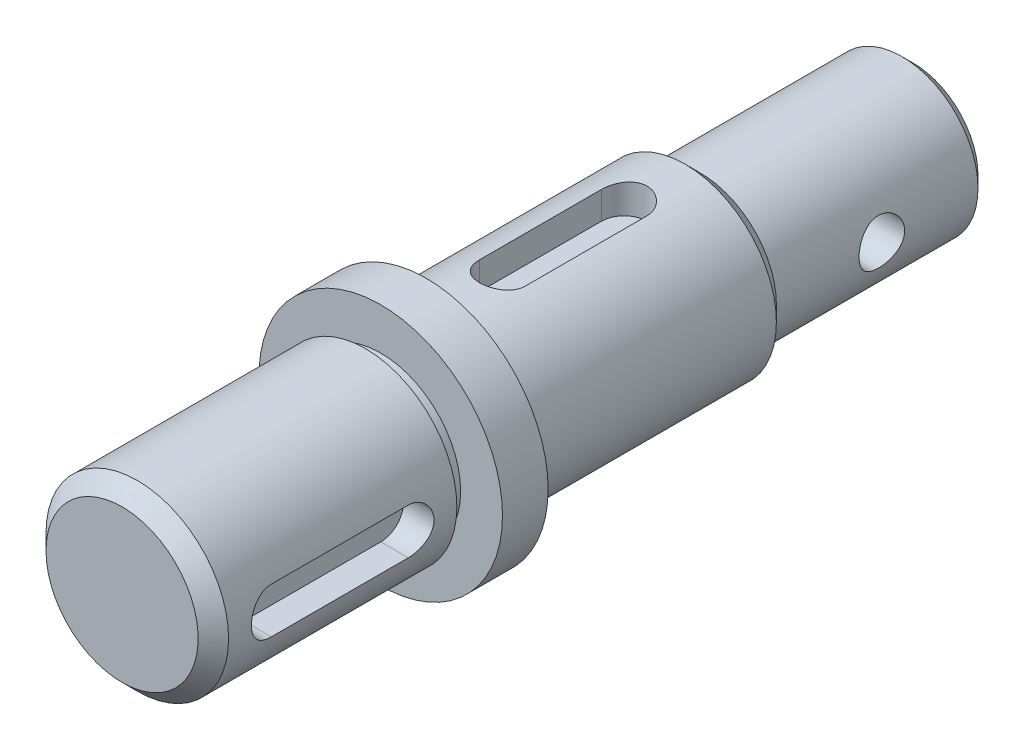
ISO-10303-21;
HEADER;
FILE_DESCRIPTION(('STEP AP214'),'2;1');
FILE_NAME('part.step','',(''),(''),'','','');
FILE_SCHEMA(('AUTOMOTIVE_DESIGN { 1 0 10303 214 1 1 1 1 }'));
ENDSEC;
DATA;
#1=APPLICATION_CONTEXT('core data for automotive mechanical design processes');
#2=APPLICATION_PROTOCOL_DEFINITION('international standard','automotive_design',2000,#1);
#3=PRODUCT_CONTEXT('',#1,'mechanical');
#4=PRODUCT('Part','Part','',(#3));
#5=PRODUCT_RELATED_PRODUCT_CATEGORY('part','',(#4));
#6=PRODUCT_DEFINITION_FORMATION('','',#4);
#7=PRODUCT_DEFINITION_CONTEXT('part definition',#1,'design');
#8=PRODUCT_DEFINITION('design','',#6,#7);
#9=PRODUCT_DEFINITION_SHAPE('','',#8);
#10=(LENGTH_UNIT() NAMED_UNIT(*) SI_UNIT(.MILLI.,.METRE.));
#11=(NAMED_UNIT(*) PLANE_ANGLE_UNIT() SI_UNIT($,.RADIAN.));
#12=(NAMED_UNIT(*) SI_UNIT($,.STERADIAN.) SOLID_ANGLE_UNIT());
#13=UNCERTAINTY_MEASURE_WITH_UNIT(LENGTH_MEASURE(1.E-05),#10,'distance_accuracy_value','');
#14=(GEOMETRIC_REPRESENTATION_CONTEXT(3) GLOBAL_UNCERTAINTY_ASSIGNED_CONTEXT((#13)) GLOBAL_UNIT_ASSIGNED_CONTEXT((#10,
#11,#12)) REPRESENTATION_CONTEXT('',''));
#15=CARTESIAN_POINT('',(0.,0.,0.));
#16=DIRECTION('',(0.,0.,1.));
#17=DIRECTION('',(1.,0.,0.));
#18=AXIS2_PLACEMENT_3D('',#15,#16,#17);
#19=CARTESIAN_POINT('',(0.,0.,112.994341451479));
#20=DIRECTION('',(0.,0.,-1.));
#21=DIRECTION('',(-1.,0.,0.));
#22=AXIS2_PLACEMENT_3D('',#19,#20,#21);
#23=PLANE('',#22);
#24=CARTESIAN_POINT('',(0.,0.,112.994341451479));
#25=DIRECTION('',(0.,0.,-1.));
#26=DIRECTION('',(-1.,0.,0.));
#27=AXIS2_PLACEMENT_3D('',#24,#25,#26);
#28=CIRCLE('',#27,10.);
#29=CARTESIAN_POINT('',(-10.,0.,112.994341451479));
#30=VERTEX_POINT('',#29);
#31=EDGE_CURVE('E187',#30,#30,#28,.F.);
#32=ORIENTED_EDGE('',*,*,#31,.T.);
#33=EDGE_LOOP('',(#32));
#34=FACE_BOUND('',#33,.T.);
#35=ADVANCED_FACE('F30',(#34),#23,.F.);
#36=CARTESIAN_POINT('',(0.,0.,103.768466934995));
#37=DIRECTION('',(0.,0.,1.));
#38=DIRECTION('',(1.,0.,0.));
#39=AXIS2_PLACEMENT_3D('',#36,#37,#38);
#40=CYLINDRICAL_SURFACE('',#39,12.);
#41=DIRECTION('',(0.,0.,1.));
#42=VECTOR('',#41,1.);
#43=CARTESIAN_POINT('',(11.6189500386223,3.,103.768466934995));
#44=LINE('',#43,#42);
#45=CARTESIAN_POINT('',(11.6189500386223,3.,104.994341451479));
#46=VERTEX_POINT('',#45);
#47=CARTESIAN_POINT('',(11.6189500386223,3.,86.9943414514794));
#48=VERTEX_POINT('',#47);
#49=EDGE_CURVE('E253',#46,#48,#44,.F.);
#50=ORIENTED_EDGE('',*,*,#49,.T.);
#51=CARTESIAN_POINT('',(11.6189500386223,3.,86.9943414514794));
#52=CARTESIAN_POINT('',(11.6189407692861,3.00000961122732,86.9113761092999));
#53=CARTESIAN_POINT('',(11.6198384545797,2.99655852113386,86.8284164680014));
#54=CARTESIAN_POINT('',(11.623378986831,2.98280958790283,86.6631175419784));
#55=CARTESIAN_POINT('',(11.6260215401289,2.9725128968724,86.5807781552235));
#56=CARTESIAN_POINT('',(11.632976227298,2.94517439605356,86.41746185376));
#57=CARTESIAN_POINT('',(11.6372850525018,2.92814595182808,86.3364825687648));
#58=CARTESIAN_POINT('',(11.6474360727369,2.88750208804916,86.1763148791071));
#59=CARTESIAN_POINT('',(11.6532782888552,2.8638865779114,86.0971264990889));
#60=CARTESIAN_POINT('',(11.67286043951,2.78341859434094,85.8630893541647));
#61=CARTESIAN_POINT('',(11.6886633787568,2.71691695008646,85.7116045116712));
#62=CARTESIAN_POINT('',(11.7239746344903,2.56023959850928,85.4219744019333));
#63=CARTESIAN_POINT('',(11.7434839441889,2.47005754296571,85.2838327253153));
#64=CARTESIAN_POINT('',(11.7844877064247,2.26645521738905,85.0217188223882));
#65=CARTESIAN_POINT('',(11.806013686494,2.15261228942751,84.898079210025));
#66=CARTESIAN_POINT('',(11.8483531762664,1.90582685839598,84.6714327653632));
#67=CARTESIAN_POINT('',(11.8691665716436,1.77288130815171,84.5684292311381));
#68=CARTESIAN_POINT('',(11.9080854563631,1.48937083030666,84.3846091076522));
#69=CARTESIAN_POINT('',(11.926149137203,1.33858605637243,84.304121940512));
#70=CARTESIAN_POINT('',(11.9571703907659,1.02510773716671,84.1697670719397));
#71=CARTESIAN_POINT('',(11.9701289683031,0.86241654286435,84.1158941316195));
#72=CARTESIAN_POINT('',(11.9892569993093,0.533232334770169,84.0373645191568));
#73=CARTESIAN_POINT('',(11.9955585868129,0.3668829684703,84.0121384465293));
#74=CARTESIAN_POINT('',(12.0011231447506,0.0321983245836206,83.9898313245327));
#75=CARTESIAN_POINT('',(12.0003869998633,-0.136136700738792,83.9927467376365));
#76=CARTESIAN_POINT('',(11.9920571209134,-0.4660574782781,84.0262313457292));
#77=CARTESIAN_POINT('',(11.984615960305,-0.627710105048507,84.0561853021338));
#78=CARTESIAN_POINT('',(11.9638899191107,-0.943616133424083,84.1419074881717));
#79=CARTESIAN_POINT('',(11.9506047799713,-1.09786920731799,84.1976768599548));
#80=CARTESIAN_POINT('',(11.9194499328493,-1.39622185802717,84.3339452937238));
#81=CARTESIAN_POINT('',(11.901539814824,-1.54021688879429,84.4146636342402));
#82=CARTESIAN_POINT('',(11.8630783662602,-1.81282989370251,84.5983708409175));
#83=CARTESIAN_POINT('',(11.8425266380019,-1.94144554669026,84.7013630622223));
#84=CARTESIAN_POINT('',(11.8003669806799,-2.18330816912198,84.9299781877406));
#85=CARTESIAN_POINT('',(11.7787455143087,-2.2960473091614,85.056136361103));
#86=CARTESIAN_POINT('',(11.7373850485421,-2.49890872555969,85.3258310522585));
#87=CARTESIAN_POINT('',(11.7176465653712,-2.58902481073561,85.4693723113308));
#88=CARTESIAN_POINT('',(11.6822344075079,-2.74441412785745,85.77077824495));
#89=CARTESIAN_POINT('',(11.666583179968,-2.80955105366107,85.9287158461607));
#90=CARTESIAN_POINT('',(11.6414117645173,-2.91210705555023,86.2536922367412));
#91=CARTESIAN_POINT('',(11.6318824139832,-2.94956756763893,86.4207170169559));
#92=CARTESIAN_POINT('',(11.6236587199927,-2.98171390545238,86.6567135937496));
#93=CARTESIAN_POINT('',(11.6218956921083,-2.98857237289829,86.7241005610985));
#94=CARTESIAN_POINT('',(11.6195418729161,-2.99771027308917,86.8590948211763));
#95=CARTESIAN_POINT('',(11.6189491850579,-2.99999711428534,86.9267015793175));
#96=CARTESIAN_POINT('',(11.6189500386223,-3.,86.9943414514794));
#97=B_SPLINE_CURVE_WITH_KNOTS('',3,(#51,#52,#53,#54,#55,#56,#57,#58,#59,#60,#61,#62,#63,#64,#65,
#66,#67,#68,#69,#70,#71,#72,#73,#74,#75,#76,#77,#78,#79,#80,#81,#82,#83,#84,#85,#86,#87,#88,#89,
#90,#91,#92,#93,#94,#95,#96),.UNSPECIFIED.,.F.,.F.,(4,2,2,2,2,2,2,2,2,2,2,2,2,2,2,2,2,2,2,2,2,2,
4),(0.,0.248809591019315,0.497577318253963,0.745853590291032,0.994133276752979,1.49019923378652,
1.98639831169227,2.49236907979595,2.9984206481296,3.51152900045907,4.02453630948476,
4.52715783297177,5.02971617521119,5.52111975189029,6.01254507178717,6.50841867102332,
7.00436701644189,7.51368627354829,8.02314476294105,8.53534499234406,9.04677681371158,
9.24991884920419,9.45273141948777),.UNSPECIFIED.);
#98=CARTESIAN_POINT('',(11.6189500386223,-3.,86.9943414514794));
#99=VERTEX_POINT('',#98);
#100=EDGE_CURVE('E193',#48,#99,#97,.T.);
#101=ORIENTED_EDGE('',*,*,#100,.T.);
#102=DIRECTION('',(0.,0.,1.));
#103=VECTOR('',#102,1.);
#104=CARTESIAN_POINT('',(11.6189500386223,-3.,103.768466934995));
#105=LINE('',#104,#103);
#106=CARTESIAN_POINT('',(11.6189500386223,-3.,104.994341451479));
#107=VERTEX_POINT('',#106);
#108=EDGE_CURVE('E250',#99,#107,#105,.T.);
#109=ORIENTED_EDGE('',*,*,#108,.T.);
#110=CARTESIAN_POINT('',(11.6189500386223,-3.,104.994341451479));
#111=CARTESIAN_POINT('',(11.6189407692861,-3.00000961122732,105.077306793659));
#112=CARTESIAN_POINT('',(11.6198384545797,-2.99655852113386,105.160266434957));
#113=CARTESIAN_POINT('',(11.623378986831,-2.98280958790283,105.32556536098));
#114=CARTESIAN_POINT('',(11.6260215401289,-2.9725128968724,105.407904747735));
#115=CARTESIAN_POINT('',(11.632976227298,-2.94517439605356,105.571221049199));
#116=CARTESIAN_POINT('',(11.6372850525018,-2.92814595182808,105.652200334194));
#117=CARTESIAN_POINT('',(11.6474360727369,-2.88750208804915,105.812368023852));
#118=CARTESIAN_POINT('',(11.6532782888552,-2.8638865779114,105.89155640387));
#119=CARTESIAN_POINT('',(11.67286043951,-2.78341859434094,106.125593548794));
#120=CARTESIAN_POINT('',(11.6886633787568,-2.71691695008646,106.277078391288));
#121=CARTESIAN_POINT('',(11.7239746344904,-2.56023959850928,106.566708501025));
#122=CARTESIAN_POINT('',(11.7434839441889,-2.47005754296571,106.704850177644));
#123=CARTESIAN_POINT('',(11.7844877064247,-2.26645521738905,106.966964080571));
#124=CARTESIAN_POINT('',(11.806013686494,-2.15261228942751,107.090603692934));
#125=CARTESIAN_POINT('',(11.8483531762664,-1.90582685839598,107.317250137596));
#126=CARTESIAN_POINT('',(11.8691665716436,-1.77288130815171,107.420253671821));
#127=CARTESIAN_POINT('',(11.9080854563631,-1.48937083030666,107.604073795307));
#128=CARTESIAN_POINT('',(11.926149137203,-1.33858605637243,107.684560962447));
#129=CARTESIAN_POINT('',(11.9571703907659,-1.02510773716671,107.818915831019));
#130=CARTESIAN_POINT('',(11.9701289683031,-0.86241654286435,107.872788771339));
#131=CARTESIAN_POINT('',(11.9892569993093,-0.533232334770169,107.951318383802));
#132=CARTESIAN_POINT('',(11.9955585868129,-0.3668829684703,107.97654445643));
#133=CARTESIAN_POINT('',(12.0011231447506,-0.0321983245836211,107.998851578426));
#134=CARTESIAN_POINT('',(12.0003869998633,0.136136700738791,107.995936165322));
#135=CARTESIAN_POINT('',(11.9920571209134,0.4660574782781,107.96245155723));
#136=CARTESIAN_POINT('',(11.984615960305,0.627710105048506,107.932497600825));
#137=CARTESIAN_POINT('',(11.9638899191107,0.943616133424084,107.846775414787));
#138=CARTESIAN_POINT('',(11.9506047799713,1.09786920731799,107.791006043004));
#139=CARTESIAN_POINT('',(11.9194499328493,1.39622185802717,107.654737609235));
#140=CARTESIAN_POINT('',(11.901539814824,1.54021688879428,107.574019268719));
#141=CARTESIAN_POINT('',(11.8630783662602,1.8128298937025,107.390312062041));
#142=CARTESIAN_POINT('',(11.8425266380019,1.94144554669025,107.287319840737));
#143=CARTESIAN_POINT('',(11.8003669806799,2.18330816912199,107.058704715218));
#144=CARTESIAN_POINT('',(11.7787455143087,2.29604730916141,106.932546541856));
#145=CARTESIAN_POINT('',(11.7373850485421,2.49890872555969,106.6628518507));
#146=CARTESIAN_POINT('',(11.7176465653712,2.58902481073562,106.519310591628));
#147=CARTESIAN_POINT('',(11.6822344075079,2.74441412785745,106.217904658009));
#148=CARTESIAN_POINT('',(11.666583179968,2.80955105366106,106.059967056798));
#149=CARTESIAN_POINT('',(11.6414117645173,2.91210705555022,105.734990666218));
#150=CARTESIAN_POINT('',(11.6318824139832,2.94956756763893,105.567965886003));
#151=CARTESIAN_POINT('',(11.6236587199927,2.98171390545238,105.331969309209));
#152=CARTESIAN_POINT('',(11.6218956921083,2.98857237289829,105.26458234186));
#153=CARTESIAN_POINT('',(11.6195418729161,2.99771027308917,105.129588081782));
#154=CARTESIAN_POINT('',(11.6189491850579,2.99999711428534,105.061981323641));
#155=CARTESIAN_POINT('',(11.6189500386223,3.,104.994341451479));
#156=B_SPLINE_CURVE_WITH_KNOTS('',3,(#110,#111,#112,#113,#114,#115,#116,#117,#118,#119,#120,
#121,#122,#123,#124,#125,#126,#127,#128,#129,#130,#131,#132,#133,#134,#135,#136,#137,#138,#139,
#140,#141,#142,#143,#144,#145,#146,#147,#148,#149,#150,#151,#152,#153,#154,#155),.UNSPECIFIED.,
.F.,.F.,(4,2,2,2,2,2,2,2,2,2,2,2,2,2,2,2,2,2,2,2,2,2,4),(0.,0.248809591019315,0.497577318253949,
0.745853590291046,0.994133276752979,1.49019923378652,1.98639831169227,2.49236907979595,
2.9984206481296,3.51152900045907,4.02453630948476,4.52715783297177,5.02971617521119,
5.52111975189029,6.01254507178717,6.50841867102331,7.00436701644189,7.5136862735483,
8.02314476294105,8.53534499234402,9.04677681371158,9.24991884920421,9.45273141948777),.UNSPECIFIED.);
#157=EDGE_CURVE('E53',#107,#46,#156,.T.);
#158=ORIENTED_EDGE('',*,*,#157,.T.);
#159=EDGE_LOOP('',(#50,#101,#109,#158));
#160=FACE_BOUND('',#159,.T.);
#161=CARTESIAN_POINT('',(0.,0.,110.994341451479));
#162=DIRECTION('',(0.,0.,-1.));
#163=DIRECTION('',(-1.,0.,0.));
#164=AXIS2_PLACEMENT_3D('',#161,#162,#163);
#165=CIRCLE('',#164,12.);
#166=CARTESIAN_POINT('',(-12.,0.,110.994341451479));
#167=VERTEX_POINT('',#166);
#168=EDGE_CURVE('E190',#167,#167,#165,.T.);
#169=ORIENTED_EDGE('',*,*,#168,.T.);
#170=EDGE_LOOP('',(#169));
#171=FACE_BOUND('',#170,.T.);
#172=CARTESIAN_POINT('',(0.,0.,80.9943414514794));
#173=DIRECTION('',(0.,0.,1.));
#174=DIRECTION('',(1.,0.,0.));
#175=AXIS2_PLACEMENT_3D('',#172,#173,#174);
#176=CIRCLE('',#175,12.);
#177=CARTESIAN_POINT('',(12.,0.,80.9943414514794));
#178=VERTEX_POINT('',#177);
#179=EDGE_CURVE('E178',#178,#178,#176,.T.);
#180=ORIENTED_EDGE('',*,*,#179,.T.);
#181=EDGE_LOOP('',(#180));
#182=FACE_BOUND('',#181,.T.);
#183=ADVANCED_FACE('F228',(#160,#171,#182),#40,.T.);
#184=CARTESIAN_POINT('',(0.,12.,80.9943414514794));
#185=DIRECTION('',(0.,0.,1.));
#186=DIRECTION('',(1.,0.,0.));
#187=AXIS2_PLACEMENT_3D('',#184,#185,#186);
#188=PLANE('',#187);
#189=ORIENTED_EDGE('',*,*,#179,.F.);
#190=EDGE_LOOP('',(#189));
#191=FACE_BOUND('',#190,.T.);
#192=CARTESIAN_POINT('',(0.,0.,80.9943414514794));
#193=DIRECTION('',(0.,0.,1.));
#194=DIRECTION('',(1.,0.,0.));
#195=AXIS2_PLACEMENT_3D('',#192,#193,#194);
#196=CIRCLE('',#195,10.5);
#197=CARTESIAN_POINT('',(10.5,0.,80.9943414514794));
#198=VERTEX_POINT('',#197);
#199=EDGE_CURVE('E175',#198,#198,#196,.T.);
#200=ORIENTED_EDGE('',*,*,#199,.T.);
#201=EDGE_LOOP('',(#200));
#202=FACE_BOUND('',#201,.T.);
#203=ADVANCED_FACE('F234',(#191,#202),#188,.F.);
#204=CARTESIAN_POINT('',(0.,0.,103.768466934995));
#205=DIRECTION('',(0.,0.,1.));
#206=DIRECTION('',(1.,0.,0.));
#207=AXIS2_PLACEMENT_3D('',#204,#205,#206);
#208=CYLINDRICAL_SURFACE('',#207,10.5);
#209=ORIENTED_EDGE('',*,*,#199,.F.);
#210=EDGE_LOOP('',(#209));
#211=FACE_BOUND('',#210,.T.);
#212=CARTESIAN_POINT('',(0.,0.,78.9943414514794));
#213=DIRECTION('',(0.,0.,1.));
#214=DIRECTION('',(1.,0.,0.));
#215=AXIS2_PLACEMENT_3D('',#212,#213,#214);
#216=CIRCLE('',#215,10.5);
#217=CARTESIAN_POINT('',(10.5,0.,78.9943414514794));
#218=VERTEX_POINT('',#217);
#219=EDGE_CURVE('E172',#218,#218,#216,.T.);
#220=ORIENTED_EDGE('',*,*,#219,.T.);
#221=EDGE_LOOP('',(#220));
#222=FACE_BOUND('',#221,.T.);
#223=ADVANCED_FACE('F311',(#211,#222),#208,.T.);
#224=CARTESIAN_POINT('',(0.,10.5,78.9943414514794));
#225=DIRECTION('',(0.,0.,-1.));
#226=DIRECTION('',(-1.,0.,0.));
#227=AXIS2_PLACEMENT_3D('',#224,#225,#226);
#228=PLANE('',#227);
#229=ORIENTED_EDGE('',*,*,#219,.F.);
#230=EDGE_LOOP('',(#229));
#231=FACE_BOUND('',#230,.T.);
#232=CARTESIAN_POINT('',(0.,0.,78.9943414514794));
#233=DIRECTION('',(0.,0.,1.));
#234=DIRECTION('',(1.,0.,0.));
#235=AXIS2_PLACEMENT_3D('',#232,#233,#234);
#236=CIRCLE('',#235,16.);
#237=CARTESIAN_POINT('',(16.,0.,78.9943414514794));
#238=VERTEX_POINT('',#237);
#239=EDGE_CURVE('E169',#238,#238,#236,.T.);
#240=ORIENTED_EDGE('',*,*,#239,.T.);
#241=EDGE_LOOP('',(#240));
#242=FACE_BOUND('',#241,.T.);
#243=ADVANCED_FACE('F316',(#231,#242),#228,.F.);
#244=CARTESIAN_POINT('',(0.,0.,103.768466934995));
#245=DIRECTION('',(0.,0.,1.));
#246=DIRECTION('',(1.,0.,0.));
#247=AXIS2_PLACEMENT_3D('',#244,#245,#246);
#248=CYLINDRICAL_SURFACE('',#247,16.);
#249=ORIENTED_EDGE('',*,*,#239,.F.);
#250=EDGE_LOOP('',(#249));
#251=FACE_BOUND('',#250,.T.);
#252=CARTESIAN_POINT('',(0.,0.,72.9943414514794));
#253=DIRECTION('',(0.,0.,1.));
#254=DIRECTION('',(1.,0.,0.));
#255=AXIS2_PLACEMENT_3D('',#252,#253,#254);
#256=CIRCLE('',#255,16.);
#257=CARTESIAN_POINT('',(16.,0.,72.9943414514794));
#258=VERTEX_POINT('',#257);
#259=EDGE_CURVE('E166',#258,#258,#256,.T.);
#260=ORIENTED_EDGE('',*,*,#259,.T.);
#261=EDGE_LOOP('',(#260));
#262=FACE_BOUND('',#261,.T.);
#263=ADVANCED_FACE('F321',(#251,#262),#248,.T.);
#264=CARTESIAN_POINT('',(0.,16.,72.9943414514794));
#265=DIRECTION('',(0.,0.,1.));
#266=DIRECTION('',(1.,0.,0.));
#267=AXIS2_PLACEMENT_3D('',#264,#265,#266);
#268=PLANE('',#267);
#269=ORIENTED_EDGE('',*,*,#259,.F.);
#270=EDGE_LOOP('',(#269));
#271=FACE_BOUND('',#270,.T.);
#272=CARTESIAN_POINT('',(0.,0.,72.9943414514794));
#273=DIRECTION('',(0.,0.,1.));
#274=DIRECTION('',(1.,0.,0.));
#275=AXIS2_PLACEMENT_3D('',#272,#273,#274);
#276=CIRCLE('',#275,10.5);
#277=CARTESIAN_POINT('',(10.5,0.,72.9943414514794));
#278=VERTEX_POINT('',#277);
#279=EDGE_CURVE('E163',#278,#278,#276,.T.);
#280=ORIENTED_EDGE('',*,*,#279,.T.);
#281=EDGE_LOOP('',(#280));
#282=FACE_BOUND('',#281,.T.);
#283=ADVANCED_FACE('F327',(#271,#282),#268,.F.);
#284=CARTESIAN_POINT('',(0.,0.,103.768466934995));
#285=DIRECTION('',(0.,0.,1.));
#286=DIRECTION('',(1.,0.,0.));
#287=AXIS2_PLACEMENT_3D('',#284,#285,#286);
#288=CYLINDRICAL_SURFACE('',#287,10.5);
#289=ORIENTED_EDGE('',*,*,#279,.F.);
#290=EDGE_LOOP('',(#289));
#291=FACE_BOUND('',#290,.T.);
#292=CARTESIAN_POINT('',(0.,0.,70.9943414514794));
#293=DIRECTION('',(0.,0.,1.));
#294=DIRECTION('',(1.,0.,0.));
#295=AXIS2_PLACEMENT_3D('',#292,#293,#294);
#296=CIRCLE('',#295,10.5);
#297=CARTESIAN_POINT('',(10.5,0.,70.9943414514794));
#298=VERTEX_POINT('',#297);
#299=EDGE_CURVE('E160',#298,#298,#296,.T.);
#300=ORIENTED_EDGE('',*,*,#299,.T.);
#301=EDGE_LOOP('',(#300));
#302=FACE_BOUND('',#301,.T.);
#303=ADVANCED_FACE('F333',(#291,#302),#288,.T.);
#304=CARTESIAN_POINT('',(0.,10.5,70.9943414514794));
#305=DIRECTION('',(0.,0.,-1.));
#306=DIRECTION('',(-1.,0.,0.));
#307=AXIS2_PLACEMENT_3D('',#304,#305,#306);
#308=PLANE('',#307);
#309=ORIENTED_EDGE('',*,*,#299,.F.);
#310=EDGE_LOOP('',(#309));
#311=FACE_BOUND('',#310,.T.);
#312=CARTESIAN_POINT('',(0.,0.,70.9943414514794));
#313=DIRECTION('',(0.,0.,1.));
#314=DIRECTION('',(1.,0.,0.));
#315=AXIS2_PLACEMENT_3D('',#312,#313,#314);
#316=CIRCLE('',#315,12.);
#317=CARTESIAN_POINT('',(12.,0.,70.9943414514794));
#318=VERTEX_POINT('',#317);
#319=EDGE_CURVE('E157',#318,#318,#316,.T.);
#320=ORIENTED_EDGE('',*,*,#319,.T.);
#321=EDGE_LOOP('',(#320));
#322=FACE_BOUND('',#321,.T.);
#323=ADVANCED_FACE('F339',(#311,#322),#308,.F.);
#324=CARTESIAN_POINT('',(0.,0.,103.768466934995));
#325=DIRECTION('',(0.,0.,1.));
#326=DIRECTION('',(1.,0.,0.));
#327=AXIS2_PLACEMENT_3D('',#324,#325,#326);
#328=CYLINDRICAL_SURFACE('',#327,12.);
#329=DIRECTION('',(0.,0.,1.));
#330=VECTOR('',#329,1.);
#331=CARTESIAN_POINT('',(3.00000000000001,11.6189500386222,103.768466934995));
#332=LINE('',#331,#330);
#333=CARTESIAN_POINT('',(3.,11.6189500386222,46.9943414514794));
#334=VERTEX_POINT('',#333);
#335=CARTESIAN_POINT('',(3.,11.6189500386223,62.9943414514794));
#336=VERTEX_POINT('',#335);
#337=EDGE_CURVE('E11',#334,#336,#332,.T.);
#338=ORIENTED_EDGE('',*,*,#337,.T.);
#339=CARTESIAN_POINT('',(3.,11.6189500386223,62.9943414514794));
#340=CARTESIAN_POINT('',(3.00000961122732,11.6189407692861,63.0773067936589));
#341=CARTESIAN_POINT('',(2.99655852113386,11.6198384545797,63.1602664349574));
#342=CARTESIAN_POINT('',(2.98280958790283,11.623378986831,63.3255653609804));
#343=CARTESIAN_POINT('',(2.9725128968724,11.6260215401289,63.4079047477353));
#344=CARTESIAN_POINT('',(2.94517439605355,11.632976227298,63.5712210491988));
#345=CARTESIAN_POINT('',(2.92814595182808,11.6372850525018,63.652200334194));
#346=CARTESIAN_POINT('',(2.88750208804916,11.6474360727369,63.8123680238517));
#347=CARTESIAN_POINT('',(2.8638865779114,11.6532782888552,63.8915564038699));
#348=CARTESIAN_POINT('',(2.78341859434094,11.67286043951,64.1255935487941));
#349=CARTESIAN_POINT('',(2.71691695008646,11.6886633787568,64.2770783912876));
#350=CARTESIAN_POINT('',(2.56023959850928,11.7239746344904,64.5667085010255));
#351=CARTESIAN_POINT('',(2.47005754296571,11.7434839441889,64.7048501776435));
#352=CARTESIAN_POINT('',(2.26645521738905,11.7844877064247,64.9669640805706));
#353=CARTESIAN_POINT('',(2.15261228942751,11.806013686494,65.0906036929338));
#354=CARTESIAN_POINT('',(1.90582685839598,11.8483531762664,65.3172501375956));
#355=CARTESIAN_POINT('',(1.77288130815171,11.8691665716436,65.4202536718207));
#356=CARTESIAN_POINT('',(1.48937083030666,11.9080854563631,65.6040737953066));
#357=CARTESIAN_POINT('',(1.33858605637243,11.926149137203,65.6845609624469));
#358=CARTESIAN_POINT('',(1.02510773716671,11.9571703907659,65.8189158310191));
#359=CARTESIAN_POINT('',(0.86241654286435,11.9701289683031,65.8727887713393));
#360=CARTESIAN_POINT('',(0.533232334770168,11.9892569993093,65.951318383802));
#361=CARTESIAN_POINT('',(0.366882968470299,11.9955585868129,65.9765444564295));
#362=CARTESIAN_POINT('',(0.0321983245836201,12.0011231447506,65.9988515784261));
#363=CARTESIAN_POINT('',(-0.136136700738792,12.0003869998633,65.9959361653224));
#364=CARTESIAN_POINT('',(-0.466057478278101,11.9920571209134,65.9624515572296));
#365=CARTESIAN_POINT('',(-0.627710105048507,11.984615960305,65.932497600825));
#366=CARTESIAN_POINT('',(-0.943616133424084,11.9638899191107,65.8467754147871));
#367=CARTESIAN_POINT('',(-1.09786920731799,11.9506047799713,65.791006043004));
#368=CARTESIAN_POINT('',(-1.39622185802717,11.9194499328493,65.654737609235));
#369=CARTESIAN_POINT('',(-1.54021688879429,11.901539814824,65.5740192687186));
#370=CARTESIAN_POINT('',(-1.81282989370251,11.8630783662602,65.3903120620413));
#371=CARTESIAN_POINT('',(-1.94144554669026,11.8425266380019,65.2873198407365));
#372=CARTESIAN_POINT('',(-2.18330816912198,11.8003669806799,65.0587047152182));
#373=CARTESIAN_POINT('',(-2.2960473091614,11.7787455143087,64.9325465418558));
#374=CARTESIAN_POINT('',(-2.49890872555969,11.7373850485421,64.6628518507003));
#375=CARTESIAN_POINT('',(-2.58902481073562,11.7176465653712,64.519310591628));
#376=CARTESIAN_POINT('',(-2.74441412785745,11.6822344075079,64.2179046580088));
#377=CARTESIAN_POINT('',(-2.80955105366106,11.666583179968,64.0599670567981));
#378=CARTESIAN_POINT('',(-2.91210705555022,11.6414117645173,63.7349906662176));
#379=CARTESIAN_POINT('',(-2.94956756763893,11.6318824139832,63.5679658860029));
#380=CARTESIAN_POINT('',(-2.98171390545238,11.6236587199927,63.3319693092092));
#381=CARTESIAN_POINT('',(-2.98857237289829,11.6218956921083,63.2645823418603));
#382=CARTESIAN_POINT('',(-2.99771027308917,11.6195418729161,63.1295880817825));
#383=CARTESIAN_POINT('',(-2.99999711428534,11.6189491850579,63.0619813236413));
#384=CARTESIAN_POINT('',(-3.,11.6189500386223,62.9943414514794));
#385=B_SPLINE_CURVE_WITH_KNOTS('',3,(#339,#340,#341,#342,#343,#344,#345,#346,#347,#348,#349,
#350,#351,#352,#353,#354,#355,#356,#357,#358,#359,#360,#361,#362,#363,#364,#365,#366,#367,#368,
#369,#370,#371,#372,#373,#374,#375,#376,#377,#378,#379,#380,#381,#382,#383,#384),.UNSPECIFIED.,
.F.,.F.,(4,2,2,2,2,2,2,2,2,2,2,2,2,2,2,2,2,2,2,2,2,2,4),(0.,0.248809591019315,0.497577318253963,
0.745853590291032,0.994133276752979,1.49019923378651,1.98639831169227,2.49236907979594,
2.9984206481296,3.51152900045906,4.02453630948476,4.52715783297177,5.02971617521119,
5.52111975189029,6.01254507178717,6.50841867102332,7.00436701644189,7.51368627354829,
8.02314476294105,8.53534499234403,9.04677681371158,9.2499188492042,9.45273141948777),.UNSPECIFIED.);
#386=CARTESIAN_POINT('',(-3.,11.6189500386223,62.9943414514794));
#387=VERTEX_POINT('',#386);
#388=EDGE_CURVE('E256',#336,#387,#385,.T.);
#389=ORIENTED_EDGE('',*,*,#388,.T.);
#390=DIRECTION('',(0.,0.,1.));
#391=VECTOR('',#390,1.);
#392=CARTESIAN_POINT('',(-2.99999999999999,11.6189500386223,103.768466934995));
#393=LINE('',#392,#391);
#394=CARTESIAN_POINT('',(-2.99999999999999,11.6189500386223,46.9943414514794));
#395=VERTEX_POINT('',#394);
#396=EDGE_CURVE('E38',#387,#395,#393,.F.);
#397=ORIENTED_EDGE('',*,*,#396,.T.);
#398=CARTESIAN_POINT('',(-3.,11.6189500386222,46.9943414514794));
#399=CARTESIAN_POINT('',(-3.00000961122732,11.6189407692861,46.9113761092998));
#400=CARTESIAN_POINT('',(-2.99655852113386,11.6198384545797,46.8284164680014));
#401=CARTESIAN_POINT('',(-2.98280958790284,11.623378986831,46.6631175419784));
#402=CARTESIAN_POINT('',(-2.9725128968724,11.6260215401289,46.5807781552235));
#403=CARTESIAN_POINT('',(-2.94517439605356,11.632976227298,46.41746185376));
#404=CARTESIAN_POINT('',(-2.92814595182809,11.6372850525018,46.3364825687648));
#405=CARTESIAN_POINT('',(-2.88750208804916,11.6474360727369,46.1763148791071));
#406=CARTESIAN_POINT('',(-2.8638865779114,11.6532782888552,46.0971264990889));
#407=CARTESIAN_POINT('',(-2.78341859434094,11.67286043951,45.8630893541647));
#408=CARTESIAN_POINT('',(-2.71691695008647,11.6886633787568,45.7116045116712));
#409=CARTESIAN_POINT('',(-2.56023959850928,11.7239746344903,45.4219744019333));
#410=CARTESIAN_POINT('',(-2.47005754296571,11.7434839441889,45.2838327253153));
#411=CARTESIAN_POINT('',(-2.26645521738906,11.7844877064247,45.0217188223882));
#412=CARTESIAN_POINT('',(-2.15261228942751,11.806013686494,44.8980792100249));
#413=CARTESIAN_POINT('',(-1.90582685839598,11.8483531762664,44.6714327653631));
#414=CARTESIAN_POINT('',(-1.77288130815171,11.8691665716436,44.568429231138));
#415=CARTESIAN_POINT('',(-1.48937083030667,11.9080854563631,44.3846091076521));
#416=CARTESIAN_POINT('',(-1.33858605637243,11.926149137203,44.3041219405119));
#417=CARTESIAN_POINT('',(-1.02510773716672,11.9571703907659,44.1697670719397));
#418=CARTESIAN_POINT('',(-0.862416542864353,11.9701289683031,44.1158941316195));
#419=CARTESIAN_POINT('',(-0.533232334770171,11.9892569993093,44.0373645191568));
#420=CARTESIAN_POINT('',(-0.366882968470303,11.9955585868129,44.0121384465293));
#421=CARTESIAN_POINT('',(-0.0321983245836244,12.0011231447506,43.9898313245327));
#422=CARTESIAN_POINT('',(0.136136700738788,12.0003869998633,43.9927467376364));
#423=CARTESIAN_POINT('',(0.466057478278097,11.9920571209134,44.0262313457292));
#424=CARTESIAN_POINT('',(0.627710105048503,11.984615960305,44.0561853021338));
#425=CARTESIAN_POINT('',(0.943616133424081,11.9638899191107,44.1419074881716));
#426=CARTESIAN_POINT('',(1.09786920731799,11.9506047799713,44.1976768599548));
#427=CARTESIAN_POINT('',(1.39622185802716,11.9194499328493,44.3339452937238));
#428=CARTESIAN_POINT('',(1.54021688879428,11.901539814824,44.4146636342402));
#429=CARTESIAN_POINT('',(1.8128298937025,11.8630783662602,44.5983708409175));
#430=CARTESIAN_POINT('',(1.94144554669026,11.8425266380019,44.7013630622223));
#431=CARTESIAN_POINT('',(2.18330816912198,11.8003669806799,44.9299781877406));
#432=CARTESIAN_POINT('',(2.2960473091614,11.7787455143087,45.056136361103));
#433=CARTESIAN_POINT('',(2.49890872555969,11.7373850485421,45.3258310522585));
#434=CARTESIAN_POINT('',(2.58902481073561,11.7176465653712,45.4693723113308));
#435=CARTESIAN_POINT('',(2.74441412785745,11.6822344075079,45.77077824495));
#436=CARTESIAN_POINT('',(2.80955105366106,11.666583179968,45.9287158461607));
#437=CARTESIAN_POINT('',(2.91210705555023,11.6414117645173,46.2536922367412));
#438=CARTESIAN_POINT('',(2.94956756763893,11.6318824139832,46.4207170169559));
#439=CARTESIAN_POINT('',(2.98171390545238,11.6236587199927,46.6567135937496));
#440=CARTESIAN_POINT('',(2.98857237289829,11.6218956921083,46.7241005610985));
#441=CARTESIAN_POINT('',(2.99771027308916,11.6195418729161,46.8590948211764));
#442=CARTESIAN_POINT('',(2.99999711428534,11.6189491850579,46.9267015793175));
#443=CARTESIAN_POINT('',(3.,11.6189500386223,46.9943414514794));
#444=B_SPLINE_CURVE_WITH_KNOTS('',3,(#398,#399,#400,#401,#402,#403,#404,#405,#406,#407,#408,
#409,#410,#411,#412,#413,#414,#415,#416,#417,#418,#419,#420,#421,#422,#423,#424,#425,#426,#427,
#428,#429,#430,#431,#432,#433,#434,#435,#436,#437,#438,#439,#440,#441,#442,#443),.UNSPECIFIED.,
.F.,.F.,(4,2,2,2,2,2,2,2,2,2,2,2,2,2,2,2,2,2,2,2,2,2,4),(0.,0.248809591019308,0.497577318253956,
0.745853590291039,0.994133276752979,1.49019923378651,1.98639831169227,2.49236907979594,
2.9984206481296,3.51152900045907,4.02453630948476,4.52715783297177,5.02971617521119,
5.52111975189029,6.01254507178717,6.50841867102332,7.00436701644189,7.51368627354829,
8.02314476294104,8.53534499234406,9.0467768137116,9.24991884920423,9.45273141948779),.UNSPECIFIED.);
#445=EDGE_CURVE('E45',#395,#334,#444,.T.);
#446=ORIENTED_EDGE('',*,*,#445,.T.);
#447=EDGE_LOOP('',(#338,#389,#397,#446));
#448=FACE_BOUND('',#447,.T.);
#449=ORIENTED_EDGE('',*,*,#319,.F.);
#450=EDGE_LOOP('',(#449));
#451=FACE_BOUND('',#450,.T.);
#452=CARTESIAN_POINT('',(0.,0.,38.9943414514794));
#453=DIRECTION('',(0.,0.,1.));
#454=DIRECTION('',(1.,0.,0.));
#455=AXIS2_PLACEMENT_3D('',#452,#453,#454);
#456=CIRCLE('',#455,12.);
#457=CARTESIAN_POINT('',(12.,0.,38.9943414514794));
#458=VERTEX_POINT('',#457);
#459=EDGE_CURVE('E153',#458,#458,#456,.T.);
#460=ORIENTED_EDGE('',*,*,#459,.T.);
#461=EDGE_LOOP('',(#460));
#462=FACE_BOUND('',#461,.T.);
#463=ADVANCED_FACE('F268',(#448,#451,#462),#328,.T.);
#464=CARTESIAN_POINT('',(0.,0.,36.9943414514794));
#465=DIRECTION('',(0.,0.,1.));
#466=DIRECTION('',(1.,0.,0.));
#467=AXIS2_PLACEMENT_3D('',#464,#465,#466);
#468=CONICAL_SURFACE('',#467,10.,0.785398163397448);
#469=ORIENTED_EDGE('',*,*,#459,.F.);
#470=EDGE_LOOP('',(#469));
#471=FACE_BOUND('',#470,.T.);
#472=CARTESIAN_POINT('',(0.,0.,36.9943414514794));
#473=DIRECTION('',(0.,0.,1.));
#474=DIRECTION('',(1.,0.,0.));
#475=AXIS2_PLACEMENT_3D('',#472,#473,#474);
#476=CIRCLE('',#475,10.);
#477=CARTESIAN_POINT('',(10.,0.,36.9943414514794));
#478=VERTEX_POINT('',#477);
#479=EDGE_CURVE('E150',#478,#478,#476,.T.);
#480=ORIENTED_EDGE('',*,*,#479,.T.);
#481=EDGE_LOOP('',(#480));
#482=FACE_BOUND('',#481,.T.);
#483=ADVANCED_FACE('F225',(#471,#482),#468,.T.);
#484=CARTESIAN_POINT('',(0.,0.,103.768466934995));
#485=DIRECTION('',(0.,0.,1.));
#486=DIRECTION('',(1.,0.,0.));
#487=AXIS2_PLACEMENT_3D('',#484,#485,#486);
#488=CYLINDRICAL_SURFACE('',#487,10.);
#489=CARTESIAN_POINT('',(10.,0.,20.1263590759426));
#490=CARTESIAN_POINT('',(9.999998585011,-0.1645772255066,20.1263610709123));
#491=CARTESIAN_POINT('',(9.99589831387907,-0.329174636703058,20.1399468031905));
#492=CARTESIAN_POINT('',(9.97994211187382,-0.653576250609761,20.1938017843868));
#493=CARTESIAN_POINT('',(9.96808386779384,-0.81337900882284,20.2340789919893));
#494=CARTESIAN_POINT('',(9.93791105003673,-1.12346541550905,20.3398511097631));
#495=CARTESIAN_POINT('',(9.91960600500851,-1.27376272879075,20.4053088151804));
#496=CARTESIAN_POINT('',(9.8784421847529,-1.56124836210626,20.5594312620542));
#497=CARTESIAN_POINT('',(9.85558280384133,-1.69843493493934,20.6480990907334));
#498=CARTESIAN_POINT('',(9.80701474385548,-1.95974359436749,20.8488070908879));
#499=CARTESIAN_POINT('',(9.78124767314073,-2.08343614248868,20.9613923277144));
#500=CARTESIAN_POINT('',(9.73011668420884,-2.31049841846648,21.2055775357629));
#501=CARTESIAN_POINT('',(9.70475283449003,-2.41386472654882,21.3371807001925));
#502=CARTESIAN_POINT('',(9.65668227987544,-2.59960075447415,21.6193005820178));
#503=CARTESIAN_POINT('',(9.63404813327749,-2.68144618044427,21.770175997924));
#504=CARTESIAN_POINT('',(9.59487240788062,-2.81842789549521,22.0843375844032));
#505=CARTESIAN_POINT('',(9.57832936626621,-2.87357059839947,22.2476207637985));
#506=CARTESIAN_POINT('',(9.55381741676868,-2.95403267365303,22.5771396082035));
#507=CARTESIAN_POINT('',(9.54562138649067,-2.98014392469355,22.7431645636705));
#508=CARTESIAN_POINT('',(9.53805579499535,-3.00427461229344,23.0774253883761));
#509=CARTESIAN_POINT('',(9.53868409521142,-3.00230085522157,23.2456607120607));
#510=CARTESIAN_POINT('',(9.54849488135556,-2.97093954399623,23.5731268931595));
#511=CARTESIAN_POINT('',(9.55736777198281,-2.94254410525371,23.732463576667));
#512=CARTESIAN_POINT('',(9.58216712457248,-2.86074840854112,24.0439986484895));
#513=CARTESIAN_POINT('',(9.59809428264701,-2.80734568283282,24.1961963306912));
#514=CARTESIAN_POINT('',(9.63545466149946,-2.67632053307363,24.4915597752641));
#515=CARTESIAN_POINT('',(9.65696032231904,-2.59837633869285,24.6345732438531));
#516=CARTESIAN_POINT('',(9.70301974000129,-2.42070445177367,24.905823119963));
#517=CARTESIAN_POINT('',(9.72757423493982,-2.32097148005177,25.0340559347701));
#518=CARTESIAN_POINT('',(9.77822022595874,-2.09762581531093,25.2777314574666));
#519=CARTESIAN_POINT('',(9.80433308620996,-1.97318981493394,25.3924164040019));
#520=CARTESIAN_POINT('',(9.85424488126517,-1.70652651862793,25.5994670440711));
#521=CARTESIAN_POINT('',(9.8780436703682,-1.56429810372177,25.6918313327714));
#522=CARTESIAN_POINT('',(9.92086320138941,-1.2647100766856,25.852078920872));
#523=CARTESIAN_POINT('',(9.93985087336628,-1.1072554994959,25.9197941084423));
#524=CARTESIAN_POINT('',(9.97067043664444,-0.782490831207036,26.0275582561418));
#525=CARTESIAN_POINT('',(9.98250432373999,-0.615183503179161,26.0676149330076));
#526=CARTESIAN_POINT('',(9.99736729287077,-0.281904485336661,26.1176634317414));
#527=CARTESIAN_POINT('',(10.0006970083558,-0.116100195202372,26.1286822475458));
#528=CARTESIAN_POINT('',(9.99905846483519,0.214999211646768,26.1232207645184));
#529=CARTESIAN_POINT('',(9.99409131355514,0.380294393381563,26.1067441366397));
#530=CARTESIAN_POINT('',(9.97661393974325,0.701807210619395,26.0475898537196));
#531=CARTESIAN_POINT('',(9.96427659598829,0.85814554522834,26.0055123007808));
#532=CARTESIAN_POINT('',(9.9334869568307,1.16150927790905,25.8970726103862));
#533=CARTESIAN_POINT('',(9.91503392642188,1.30853355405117,25.8307075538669));
#534=CARTESIAN_POINT('',(9.87339308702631,1.59287437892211,25.6738527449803));
#535=CARTESIAN_POINT('',(9.8501056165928,1.72988765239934,25.5828403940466));
#536=CARTESIAN_POINT('',(9.80146937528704,1.9870466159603,25.379909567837));
#537=CARTESIAN_POINT('',(9.7761200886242,2.10718806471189,25.2679858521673));
#538=CARTESIAN_POINT('',(9.72506343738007,2.33171489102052,25.0215844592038));
#539=CARTESIAN_POINT('',(9.69937650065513,2.43536962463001,24.8864353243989));
#540=CARTESIAN_POINT('',(9.65153030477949,2.61857990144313,24.6001031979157));
#541=CARTESIAN_POINT('',(9.62937095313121,2.69813607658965,24.4489206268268));
#542=CARTESIAN_POINT('',(9.5913437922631,2.83034694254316,24.1352940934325));
#543=CARTESIAN_POINT('',(9.575446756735,2.88312693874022,23.9729067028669));
#544=CARTESIAN_POINT('',(9.55183188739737,2.96043461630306,23.6409831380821));
#545=CARTESIAN_POINT('',(9.54411125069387,2.98497197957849,23.4714494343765));
#546=CARTESIAN_POINT('',(9.53799944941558,3.0044396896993,23.1376360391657));
#547=CARTESIAN_POINT('',(9.53923294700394,3.00056110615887,22.9734317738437));
#548=CARTESIAN_POINT('',(9.54998802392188,2.9661501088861,22.6481308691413));
#549=CARTESIAN_POINT('',(9.55950927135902,2.93561876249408,22.4870341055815));
#550=CARTESIAN_POINT('',(9.58551527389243,2.84953777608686,22.1744682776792));
#551=CARTESIAN_POINT('',(9.60191209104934,2.79430351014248,22.0229045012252));
#552=CARTESIAN_POINT('',(9.63980557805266,2.66063014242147,21.7310741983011));
#553=CARTESIAN_POINT('',(9.6613032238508,2.58218659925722,21.5908098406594));
#554=CARTESIAN_POINT('',(9.70795352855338,2.40097527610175,21.32003284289));
#555=CARTESIAN_POINT('',(9.7332108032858,2.29742552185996,21.1900615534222));
#556=CARTESIAN_POINT('',(9.78402640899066,2.07034869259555,20.9489540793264));
#557=CARTESIAN_POINT('',(9.80958481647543,1.94681643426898,20.8378227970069));
#558=CARTESIAN_POINT('',(9.85901873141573,1.67893152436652,20.6343122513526));
#559=CARTESIAN_POINT('',(9.88282319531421,1.53407577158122,20.5425761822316));
#560=CARTESIAN_POINT('',(9.92521360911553,1.23028274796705,20.3848887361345));
#561=CARTESIAN_POINT('',(9.94380199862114,1.07135210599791,20.3189252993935));
#562=CARTESIAN_POINT('',(9.97204349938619,0.761515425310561,20.2205685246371));
#563=CARTESIAN_POINT('',(9.9824405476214,0.611573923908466,20.1853357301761));
#564=CARTESIAN_POINT('',(9.9964188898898,0.307760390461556,20.1382320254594));
#565=CARTESIAN_POINT('',(10.0000013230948,0.153889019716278,20.1263572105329));
#566=CARTESIAN_POINT('',(10.,0.,20.1263590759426));
#567=B_SPLINE_CURVE_WITH_KNOTS('',3,(#489,#490,#491,#492,#493,#494,#495,#496,#497,#498,#499,
#500,#501,#502,#503,#504,#505,#506,#507,#508,#509,#510,#511,#512,#513,#514,#515,#516,#517,#518,
#519,#520,#521,#522,#523,#524,#525,#526,#527,#528,#529,#530,#531,#532,#533,#534,#535,#536,#537,
#538,#539,#540,#541,#542,#543,#544,#545,#546,#547,#548,#549,#550,#551,#552,#553,#554,#555,#556,
#557,#558,#559,#560,#561,#562,#563,#564,#565,#566),.UNSPECIFIED.,.T.,.F.,(4,2,2,2,2,2,2,2,2,2,2,
2,2,2,2,2,2,2,2,2,2,2,2,2,2,2,2,2,2,2,2,2,2,2,2,2,2,2,4),(0.,0.493166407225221,
0.986479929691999,1.47906735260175,1.97172032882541,2.47711205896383,2.98258874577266,
3.49942962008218,4.01614629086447,4.51839378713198,5.02051956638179,5.50452033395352,
5.98856887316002,6.47924852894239,6.97004720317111,7.48134208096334,7.99266913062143,
8.50742093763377,9.02202907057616,9.5181761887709,10.0142570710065,10.4991349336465,
10.9840710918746,11.4802261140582,11.9765056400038,12.4908080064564,13.0050968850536,
13.516956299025,14.0286401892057,14.5190031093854,15.0093463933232,15.4936008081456,
15.9779479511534,16.4799385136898,16.9820594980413,17.4988599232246,18.0154182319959,
18.4766338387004,18.9377723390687),.UNSPECIFIED.);
#568=CARTESIAN_POINT('',(10.,0.,20.1263590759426));
#569=VERTEX_POINT('',#568);
#570=EDGE_CURVE('E154',#569,#569,#567,.T.);
#571=ORIENTED_EDGE('',*,*,#570,.T.);
#572=EDGE_LOOP('',(#571));
#573=FACE_BOUND('',#572,.T.);
#574=CARTESIAN_POINT('',(-10.,0.,20.1263590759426));
#575=CARTESIAN_POINT('',(-9.999998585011,0.1645772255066,20.1263610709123));
#576=CARTESIAN_POINT('',(-9.99589831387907,0.329174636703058,20.1399468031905));
#577=CARTESIAN_POINT('',(-9.97994211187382,0.653576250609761,20.1938017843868));
#578=CARTESIAN_POINT('',(-9.96808386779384,0.81337900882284,20.2340789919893));
#579=CARTESIAN_POINT('',(-9.93791105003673,1.12346541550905,20.3398511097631));
#580=CARTESIAN_POINT('',(-9.91960600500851,1.27376272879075,20.4053088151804));
#581=CARTESIAN_POINT('',(-9.8784421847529,1.56124836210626,20.5594312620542));
#582=CARTESIAN_POINT('',(-9.85558280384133,1.69843493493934,20.6480990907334));
#583=CARTESIAN_POINT('',(-9.80701474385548,1.95974359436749,20.8488070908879));
#584=CARTESIAN_POINT('',(-9.78124767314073,2.08343614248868,20.9613923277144));
#585=CARTESIAN_POINT('',(-9.73011668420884,2.31049841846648,21.2055775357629));
#586=CARTESIAN_POINT('',(-9.70475283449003,2.41386472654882,21.3371807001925));
#587=CARTESIAN_POINT('',(-9.65668227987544,2.59960075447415,21.6193005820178));
#588=CARTESIAN_POINT('',(-9.63404813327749,2.68144618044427,21.770175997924));
#589=CARTESIAN_POINT('',(-9.59487240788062,2.81842789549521,22.0843375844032));
#590=CARTESIAN_POINT('',(-9.57832936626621,2.87357059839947,22.2476207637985));
#591=CARTESIAN_POINT('',(-9.55381741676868,2.95403267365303,22.5771396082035));
#592=CARTESIAN_POINT('',(-9.54562138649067,2.98014392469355,22.7431645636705));
#593=CARTESIAN_POINT('',(-9.53805579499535,3.00427461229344,23.0774253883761));
#594=CARTESIAN_POINT('',(-9.53868409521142,3.00230085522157,23.2456607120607));
#595=CARTESIAN_POINT('',(-9.54849488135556,2.97093954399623,23.5731268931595));
#596=CARTESIAN_POINT('',(-9.55736777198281,2.94254410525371,23.732463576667));
#597=CARTESIAN_POINT('',(-9.58216712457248,2.86074840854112,24.0439986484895));
#598=CARTESIAN_POINT('',(-9.59809428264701,2.80734568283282,24.1961963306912));
#599=CARTESIAN_POINT('',(-9.63545466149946,2.67632053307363,24.4915597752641));
#600=CARTESIAN_POINT('',(-9.65696032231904,2.59837633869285,24.6345732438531));
#601=CARTESIAN_POINT('',(-9.70301974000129,2.42070445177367,24.905823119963));
#602=CARTESIAN_POINT('',(-9.72757423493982,2.32097148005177,25.0340559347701));
#603=CARTESIAN_POINT('',(-9.77822022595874,2.09762581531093,25.2777314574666));
#604=CARTESIAN_POINT('',(-9.80433308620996,1.97318981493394,25.3924164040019));
#605=CARTESIAN_POINT('',(-9.85424488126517,1.70652651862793,25.5994670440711));
#606=CARTESIAN_POINT('',(-9.8780436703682,1.56429810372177,25.6918313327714));
#607=CARTESIAN_POINT('',(-9.92086320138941,1.2647100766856,25.852078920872));
#608=CARTESIAN_POINT('',(-9.93985087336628,1.1072554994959,25.9197941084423));
#609=CARTESIAN_POINT('',(-9.97067043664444,0.782490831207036,26.0275582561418));
#610=CARTESIAN_POINT('',(-9.98250432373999,0.615183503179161,26.0676149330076));
#611=CARTESIAN_POINT('',(-9.99736729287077,0.281904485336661,26.1176634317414));
#612=CARTESIAN_POINT('',(-10.0006970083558,0.116100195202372,26.1286822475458));
#613=CARTESIAN_POINT('',(-9.99905846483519,-0.214999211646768,26.1232207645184));
#614=CARTESIAN_POINT('',(-9.99409131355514,-0.380294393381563,26.1067441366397));
#615=CARTESIAN_POINT('',(-9.97661393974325,-0.701807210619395,26.0475898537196));
#616=CARTESIAN_POINT('',(-9.96427659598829,-0.85814554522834,26.0055123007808));
#617=CARTESIAN_POINT('',(-9.9334869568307,-1.16150927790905,25.8970726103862));
#618=CARTESIAN_POINT('',(-9.91503392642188,-1.30853355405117,25.8307075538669));
#619=CARTESIAN_POINT('',(-9.87339308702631,-1.59287437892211,25.6738527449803));
#620=CARTESIAN_POINT('',(-9.8501056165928,-1.72988765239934,25.5828403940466));
#621=CARTESIAN_POINT('',(-9.80146937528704,-1.9870466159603,25.379909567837));
#622=CARTESIAN_POINT('',(-9.7761200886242,-2.10718806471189,25.2679858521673));
#623=CARTESIAN_POINT('',(-9.72506343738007,-2.33171489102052,25.0215844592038));
#624=CARTESIAN_POINT('',(-9.69937650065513,-2.43536962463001,24.8864353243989));
#625=CARTESIAN_POINT('',(-9.65153030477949,-2.61857990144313,24.6001031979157));
#626=CARTESIAN_POINT('',(-9.62937095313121,-2.69813607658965,24.4489206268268));
#627=CARTESIAN_POINT('',(-9.5913437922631,-2.83034694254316,24.1352940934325));
#628=CARTESIAN_POINT('',(-9.575446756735,-2.88312693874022,23.9729067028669));
#629=CARTESIAN_POINT('',(-9.55183188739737,-2.96043461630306,23.6409831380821));
#630=CARTESIAN_POINT('',(-9.54411125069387,-2.98497197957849,23.4714494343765));
#631=CARTESIAN_POINT('',(-9.53799944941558,-3.0044396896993,23.1376360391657));
#632=CARTESIAN_POINT('',(-9.53923294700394,-3.00056110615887,22.9734317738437));
#633=CARTESIAN_POINT('',(-9.54998802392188,-2.9661501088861,22.6481308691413));
#634=CARTESIAN_POINT('',(-9.55950927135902,-2.93561876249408,22.4870341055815));
#635=CARTESIAN_POINT('',(-9.58551527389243,-2.84953777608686,22.1744682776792));
#636=CARTESIAN_POINT('',(-9.60191209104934,-2.79430351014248,22.0229045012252));
#637=CARTESIAN_POINT('',(-9.63980557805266,-2.66063014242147,21.7310741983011));
#638=CARTESIAN_POINT('',(-9.6613032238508,-2.58218659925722,21.5908098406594));
#639=CARTESIAN_POINT('',(-9.70795352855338,-2.40097527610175,21.32003284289));
#640=CARTESIAN_POINT('',(-9.7332108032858,-2.29742552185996,21.1900615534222));
#641=CARTESIAN_POINT('',(-9.78402640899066,-2.07034869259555,20.9489540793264));
#642=CARTESIAN_POINT('',(-9.80958481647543,-1.94681643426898,20.8378227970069));
#643=CARTESIAN_POINT('',(-9.85901873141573,-1.67893152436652,20.6343122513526));
#644=CARTESIAN_POINT('',(-9.88282319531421,-1.53407577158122,20.5425761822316));
#645=CARTESIAN_POINT('',(-9.92521360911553,-1.23028274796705,20.3848887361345));
#646=CARTESIAN_POINT('',(-9.94380199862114,-1.07135210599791,20.3189252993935));
#647=CARTESIAN_POINT('',(-9.97204349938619,-0.761515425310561,20.2205685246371));
#648=CARTESIAN_POINT('',(-9.9824405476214,-0.611573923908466,20.1853357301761));
#649=CARTESIAN_POINT('',(-9.9964188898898,-0.307760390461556,20.1382320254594));
#650=CARTESIAN_POINT('',(-10.0000013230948,-0.153889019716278,20.1263572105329));
#651=CARTESIAN_POINT('',(-10.,0.,20.1263590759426));
#652=B_SPLINE_CURVE_WITH_KNOTS('',3,(#574,#575,#576,#577,#578,#579,#580,#581,#582,#583,#584,
#585,#586,#587,#588,#589,#590,#591,#592,#593,#594,#595,#596,#597,#598,#599,#600,#601,#602,#603,
#604,#605,#606,#607,#608,#609,#610,#611,#612,#613,#614,#615,#616,#617,#618,#619,#620,#621,#622,
#623,#624,#625,#626,#627,#628,#629,#630,#631,#632,#633,#634,#635,#636,#637,#638,#639,#640,#641,
#642,#643,#644,#645,#646,#647,#648,#649,#650,#651),.UNSPECIFIED.,.T.,.F.,(4,2,2,2,2,2,2,2,2,2,2,
2,2,2,2,2,2,2,2,2,2,2,2,2,2,2,2,2,2,2,2,2,2,2,2,2,2,2,4),(0.,0.493166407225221,
0.986479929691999,1.47906735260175,1.97172032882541,2.47711205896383,2.98258874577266,
3.49942962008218,4.01614629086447,4.51839378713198,5.02051956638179,5.50452033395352,
5.98856887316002,6.47924852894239,6.97004720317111,7.48134208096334,7.99266913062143,
8.50742093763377,9.02202907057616,9.5181761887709,10.0142570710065,10.4991349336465,
10.9840710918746,11.4802261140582,11.9765056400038,12.4908080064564,13.0050968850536,
13.516956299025,14.0286401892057,14.5190031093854,15.0093463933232,15.4936008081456,
15.9779479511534,16.4799385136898,16.9820594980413,17.4988599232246,18.0154182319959,
18.4766338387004,18.9377723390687),.UNSPECIFIED.);
#653=CARTESIAN_POINT('',(-10.,0.,20.1263590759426));
#654=VERTEX_POINT('',#653);
#655=EDGE_CURVE('E142',#654,#654,#652,.T.);
#656=ORIENTED_EDGE('',*,*,#655,.T.);
#657=EDGE_LOOP('',(#656));
#658=FACE_BOUND('',#657,.T.);
#659=CARTESIAN_POINT('',(0.,0.,10.4943414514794));
#660=DIRECTION('',(0.,0.,1.));
#661=DIRECTION('',(1.,0.,0.));
#662=AXIS2_PLACEMENT_3D('',#659,#660,#661);
#663=CIRCLE('',#662,10.);
#664=CARTESIAN_POINT('',(10.,0.,10.4943414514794));
#665=VERTEX_POINT('',#664);
#666=EDGE_CURVE('E181',#665,#665,#663,.T.);
#667=ORIENTED_EDGE('',*,*,#666,.T.);
#668=EDGE_LOOP('',(#667));
#669=FACE_BOUND('',#668,.T.);
#670=ORIENTED_EDGE('',*,*,#479,.F.);
#671=EDGE_LOOP('',(#670));
#672=FACE_BOUND('',#671,.T.);
#673=ADVANCED_FACE('F203',(#573,#658,#669,#672),#488,.T.);
#674=CARTESIAN_POINT('',(0.,10.,8.9943414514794));
#675=DIRECTION('',(0.,0.,1.));
#676=DIRECTION('',(1.,0.,0.));
#677=AXIS2_PLACEMENT_3D('',#674,#675,#676);
#678=PLANE('',#677);
#679=CARTESIAN_POINT('',(0.,0.,8.9943414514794));
#680=DIRECTION('',(0.,0.,1.));
#681=DIRECTION('',(1.,0.,0.));
#682=AXIS2_PLACEMENT_3D('',#679,#680,#681);
#683=CIRCLE('',#682,8.49999999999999);
#684=CARTESIAN_POINT('',(8.49999999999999,0.,8.9943414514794));
#685=VERTEX_POINT('',#684);
#686=EDGE_CURVE('E184',#685,#685,#683,.F.);
#687=ORIENTED_EDGE('',*,*,#686,.T.);
#688=EDGE_LOOP('',(#687));
#689=FACE_BOUND('',#688,.T.);
#690=ADVANCED_FACE('F215',(#689),#678,.F.);
#691=CARTESIAN_POINT('',(0.,0.,10.4943414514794));
#692=DIRECTION('',(0.,0.,1.));
#693=DIRECTION('',(1.,0.,0.));
#694=AXIS2_PLACEMENT_3D('',#691,#692,#693);
#695=CONICAL_SURFACE('',#694,10.,0.78539816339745);
#696=ORIENTED_EDGE('',*,*,#686,.F.);
#697=EDGE_LOOP('',(#696));
#698=FACE_BOUND('',#697,.T.);
#699=ORIENTED_EDGE('',*,*,#666,.F.);
#700=EDGE_LOOP('',(#699));
#701=FACE_BOUND('',#700,.T.);
#702=ADVANCED_FACE('F218',(#698,#701),#695,.T.);
#703=CARTESIAN_POINT('',(0.,0.,112.994341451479));
#704=DIRECTION('',(0.,0.,-1.));
#705=DIRECTION('',(-1.,0.,0.));
#706=AXIS2_PLACEMENT_3D('',#703,#704,#705);
#707=CONICAL_SURFACE('',#706,10.,0.785398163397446);
#708=ORIENTED_EDGE('',*,*,#168,.F.);
#709=EDGE_LOOP('',(#708));
#710=FACE_BOUND('',#709,.T.);
#711=ORIENTED_EDGE('',*,*,#31,.F.);
#712=EDGE_LOOP('',(#711));
#713=FACE_BOUND('',#712,.T.);
#714=ADVANCED_FACE('F32',(#710,#713),#707,.T.);
#715=CARTESIAN_POINT('',(-15.,0.,23.1263590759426));
#716=DIRECTION('',(1.,0.,0.));
#717=DIRECTION('',(0.,0.,-1.));
#718=AXIS2_PLACEMENT_3D('',#715,#716,#717);
#719=CYLINDRICAL_SURFACE('',#718,3.);
#720=ORIENTED_EDGE('',*,*,#655,.F.);
#721=EDGE_LOOP('',(#720));
#722=FACE_BOUND('',#721,.T.);
#723=ORIENTED_EDGE('',*,*,#570,.F.);
#724=EDGE_LOOP('',(#723));
#725=FACE_BOUND('',#724,.T.);
#726=ADVANCED_FACE('F207',(#722,#725),#719,.F.);
#727=CARTESIAN_POINT('',(8.,0.,104.994341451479));
#728=DIRECTION('',(1.,0.,0.));
#729=DIRECTION('',(0.,0.,-1.));
#730=AXIS2_PLACEMENT_3D('',#727,#728,#729);
#731=CYLINDRICAL_SURFACE('',#730,3.);
#732=DIRECTION('',(1.,0.,0.));
#733=VECTOR('',#732,1.);
#734=CARTESIAN_POINT('',(8.,-3.,104.994341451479));
#735=LINE('',#734,#733);
#736=CARTESIAN_POINT('',(8.,-3.,104.994341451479));
#737=VERTEX_POINT('',#736);
#738=EDGE_CURVE('E139',#737,#107,#735,.T.);
#739=ORIENTED_EDGE('',*,*,#738,.F.);
#740=CARTESIAN_POINT('',(8.,0.,104.994341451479));
#741=DIRECTION('',(1.,0.,0.));
#742=DIRECTION('',(0.,0.,-1.));
#743=AXIS2_PLACEMENT_3D('',#740,#741,#742);
#744=CIRCLE('',#743,3.);
#745=CARTESIAN_POINT('',(8.,3.,104.994341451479));
#746=VERTEX_POINT('',#745);
#747=EDGE_CURVE('E123',#746,#737,#744,.T.);
#748=ORIENTED_EDGE('',*,*,#747,.F.);
#749=DIRECTION('',(1.,0.,0.));
#750=VECTOR('',#749,1.);
#751=CARTESIAN_POINT('',(8.,3.,104.994341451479));
#752=LINE('',#751,#750);
#753=EDGE_CURVE('E140',#746,#46,#752,.T.);
#754=ORIENTED_EDGE('',*,*,#753,.T.);
#755=ORIENTED_EDGE('',*,*,#157,.F.);
#756=EDGE_LOOP('',(#739,#748,#754,#755));
#757=FACE_BOUND('',#756,.T.);
#758=ADVANCED_FACE('F211',(#757),#731,.F.);
#759=CARTESIAN_POINT('',(8.,3.,104.994341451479));
#760=DIRECTION('',(0.,1.,0.));
#761=DIRECTION('',(0.,0.,1.));
#762=AXIS2_PLACEMENT_3D('',#759,#760,#761);
#763=PLANE('',#762);
#764=ORIENTED_EDGE('',*,*,#753,.F.);
#765=DIRECTION('',(0.,0.,1.));
#766=VECTOR('',#765,1.);
#767=CARTESIAN_POINT('',(8.,3.,104.994341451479));
#768=LINE('',#767,#766);
#769=CARTESIAN_POINT('',(8.,3.,86.9943414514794));
#770=VERTEX_POINT('',#769);
#771=EDGE_CURVE('E136',#770,#746,#768,.T.);
#772=ORIENTED_EDGE('',*,*,#771,.F.);
#773=DIRECTION('',(1.,0.,0.));
#774=VECTOR('',#773,1.);
#775=CARTESIAN_POINT('',(8.,3.,86.9943414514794));
#776=LINE('',#775,#774);
#777=EDGE_CURVE('E143',#770,#48,#776,.T.);
#778=ORIENTED_EDGE('',*,*,#777,.T.);
#779=ORIENTED_EDGE('',*,*,#49,.F.);
#780=EDGE_LOOP('',(#764,#772,#778,#779));
#781=FACE_BOUND('',#780,.T.);
#782=ADVANCED_FACE('F288',(#781),#763,.F.);
#783=CARTESIAN_POINT('',(8.,0.,86.9943414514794));
#784=DIRECTION('',(1.,0.,0.));
#785=DIRECTION('',(0.,0.,-1.));
#786=AXIS2_PLACEMENT_3D('',#783,#784,#785);
#787=CYLINDRICAL_SURFACE('',#786,3.);
#788=ORIENTED_EDGE('',*,*,#777,.F.);
#789=CARTESIAN_POINT('',(8.,0.,86.9943414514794));
#790=DIRECTION('',(1.,0.,0.));
#791=DIRECTION('',(0.,0.,-1.));
#792=AXIS2_PLACEMENT_3D('',#789,#790,#791);
#793=CIRCLE('',#792,3.);
#794=CARTESIAN_POINT('',(8.,-3.,86.9943414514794));
#795=VERTEX_POINT('',#794);
#796=EDGE_CURVE('E133',#795,#770,#793,.T.);
#797=ORIENTED_EDGE('',*,*,#796,.F.);
#798=DIRECTION('',(1.,0.,0.));
#799=VECTOR('',#798,1.);
#800=CARTESIAN_POINT('',(8.,-3.,86.9943414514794));
#801=LINE('',#800,#799);
#802=EDGE_CURVE('E146',#795,#99,#801,.T.);
#803=ORIENTED_EDGE('',*,*,#802,.T.);
#804=ORIENTED_EDGE('',*,*,#100,.F.);
#805=EDGE_LOOP('',(#788,#797,#803,#804));
#806=FACE_BOUND('',#805,.T.);
#807=ADVANCED_FACE('F290',(#806),#787,.F.);
#808=CARTESIAN_POINT('',(8.,-3.,104.994341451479));
#809=DIRECTION('',(0.,-1.,0.));
#810=DIRECTION('',(0.,0.,-1.));
#811=AXIS2_PLACEMENT_3D('',#808,#809,#810);
#812=PLANE('',#811);
#813=ORIENTED_EDGE('',*,*,#802,.F.);
#814=DIRECTION('',(0.,0.,-1.));
#815=VECTOR('',#814,1.);
#816=CARTESIAN_POINT('',(8.,-3.,104.994341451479));
#817=LINE('',#816,#815);
#818=EDGE_CURVE('E130',#737,#795,#817,.T.);
#819=ORIENTED_EDGE('',*,*,#818,.F.);
#820=ORIENTED_EDGE('',*,*,#738,.T.);
#821=ORIENTED_EDGE('',*,*,#108,.F.);
#822=EDGE_LOOP('',(#813,#819,#820,#821));
#823=FACE_BOUND('',#822,.T.);
#824=ADVANCED_FACE('F286',(#823),#812,.F.);
#825=CARTESIAN_POINT('',(8.,0.,104.994341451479));
#826=DIRECTION('',(1.,0.,0.));
#827=DIRECTION('',(0.,0.,-1.));
#828=AXIS2_PLACEMENT_3D('',#825,#826,#827);
#829=PLANE('',#828);
#830=ORIENTED_EDGE('',*,*,#747,.T.);
#831=ORIENTED_EDGE('',*,*,#818,.T.);
#832=ORIENTED_EDGE('',*,*,#796,.T.);
#833=ORIENTED_EDGE('',*,*,#771,.T.);
#834=EDGE_LOOP('',(#830,#831,#832,#833));
#835=FACE_BOUND('',#834,.T.);
#836=ADVANCED_FACE('F283',(#835),#829,.T.);
#837=CARTESIAN_POINT('',(0.,8.,46.9943414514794));
#838=DIRECTION('',(0.,1.,0.));
#839=DIRECTION('',(0.,0.,1.));
#840=AXIS2_PLACEMENT_3D('',#837,#838,#839);
#841=CYLINDRICAL_SURFACE('',#840,3.);
#842=DIRECTION('',(0.,1.,0.));
#843=VECTOR('',#842,1.);
#844=CARTESIAN_POINT('',(-3.,8.,46.9943414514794));
#845=LINE('',#844,#843);
#846=CARTESIAN_POINT('',(-3.,8.,46.9943414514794));
#847=VERTEX_POINT('',#846);
#848=EDGE_CURVE('E95',#847,#395,#845,.T.);
#849=ORIENTED_EDGE('',*,*,#848,.F.);
#850=CARTESIAN_POINT('',(0.,8.,46.9943414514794));
#851=DIRECTION('',(0.,1.,0.));
#852=DIRECTION('',(0.,0.,1.));
#853=AXIS2_PLACEMENT_3D('',#850,#851,#852);
#854=CIRCLE('',#853,3.);
#855=CARTESIAN_POINT('',(3.,8.,46.9943414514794));
#856=VERTEX_POINT('',#855);
#857=EDGE_CURVE('E99',#856,#847,#854,.T.);
#858=ORIENTED_EDGE('',*,*,#857,.F.);
#859=DIRECTION('',(0.,1.,0.));
#860=VECTOR('',#859,1.);
#861=CARTESIAN_POINT('',(3.,8.,46.9943414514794));
#862=LINE('',#861,#860);
#863=EDGE_CURVE('E121',#856,#334,#862,.T.);
#864=ORIENTED_EDGE('',*,*,#863,.T.);
#865=ORIENTED_EDGE('',*,*,#445,.F.);
#866=EDGE_LOOP('',(#849,#858,#864,#865));
#867=FACE_BOUND('',#866,.T.);
#868=ADVANCED_FACE('F97',(#867),#841,.F.);
#869=CARTESIAN_POINT('',(3.,8.,62.9943414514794));
#870=DIRECTION('',(1.,0.,0.));
#871=DIRECTION('',(0.,0.,-1.));
#872=AXIS2_PLACEMENT_3D('',#869,#870,#871);
#873=PLANE('',#872);
#874=ORIENTED_EDGE('',*,*,#863,.F.);
#875=DIRECTION('',(0.,0.,-1.));
#876=VECTOR('',#875,1.);
#877=CARTESIAN_POINT('',(3.,8.,62.9943414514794));
#878=LINE('',#877,#876);
#879=CARTESIAN_POINT('',(3.,8.,62.9943414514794));
#880=VERTEX_POINT('',#879);
#881=EDGE_CURVE('E104',#880,#856,#878,.T.);
#882=ORIENTED_EDGE('',*,*,#881,.F.);
#883=DIRECTION('',(0.,1.,0.));
#884=VECTOR('',#883,1.);
#885=CARTESIAN_POINT('',(3.,8.,62.9943414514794));
#886=LINE('',#885,#884);
#887=EDGE_CURVE('E124',#880,#336,#886,.T.);
#888=ORIENTED_EDGE('',*,*,#887,.T.);
#889=ORIENTED_EDGE('',*,*,#337,.F.);
#890=EDGE_LOOP('',(#874,#882,#888,#889));
#891=FACE_BOUND('',#890,.T.);
#892=ADVANCED_FACE('F276',(#891),#873,.F.);
#893=CARTESIAN_POINT('',(0.,8.,62.9943414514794));
#894=DIRECTION('',(0.,1.,0.));
#895=DIRECTION('',(0.,0.,1.));
#896=AXIS2_PLACEMENT_3D('',#893,#894,#895);
#897=CYLINDRICAL_SURFACE('',#896,3.);
#898=ORIENTED_EDGE('',*,*,#887,.F.);
#899=CARTESIAN_POINT('',(0.,8.,62.9943414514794));
#900=DIRECTION('',(0.,1.,0.));
#901=DIRECTION('',(0.,0.,1.));
#902=AXIS2_PLACEMENT_3D('',#899,#900,#901);
#903=CIRCLE('',#902,3.);
#904=CARTESIAN_POINT('',(-3.,8.,62.9943414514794));
#905=VERTEX_POINT('',#904);
#906=EDGE_CURVE('E113',#905,#880,#903,.T.);
#907=ORIENTED_EDGE('',*,*,#906,.F.);
#908=DIRECTION('',(0.,1.,0.));
#909=VECTOR('',#908,1.);
#910=CARTESIAN_POINT('',(-3.,8.,62.9943414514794));
#911=LINE('',#910,#909);
#912=EDGE_CURVE('E103',#905,#387,#911,.T.);
#913=ORIENTED_EDGE('',*,*,#912,.T.);
#914=ORIENTED_EDGE('',*,*,#388,.F.);
#915=EDGE_LOOP('',(#898,#907,#913,#914));
#916=FACE_BOUND('',#915,.T.);
#917=ADVANCED_FACE('F271',(#916),#897,.F.);
#918=CARTESIAN_POINT('',(-3.,8.,46.9943414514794));
#919=DIRECTION('',(-1.,0.,0.));
#920=DIRECTION('',(0.,0.,1.));
#921=AXIS2_PLACEMENT_3D('',#918,#919,#920);
#922=PLANE('',#921);
#923=ORIENTED_EDGE('',*,*,#912,.F.);
#924=DIRECTION('',(0.,0.,1.));
#925=VECTOR('',#924,1.);
#926=CARTESIAN_POINT('',(-3.,8.,46.9943414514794));
#927=LINE('',#926,#925);
#928=EDGE_CURVE('E107',#847,#905,#927,.T.);
#929=ORIENTED_EDGE('',*,*,#928,.F.);
#930=ORIENTED_EDGE('',*,*,#848,.T.);
#931=ORIENTED_EDGE('',*,*,#396,.F.);
#932=EDGE_LOOP('',(#923,#929,#930,#931));
#933=FACE_BOUND('',#932,.T.);
#934=ADVANCED_FACE('F108',(#933),#922,.F.);
#935=CARTESIAN_POINT('',(0.,8.,46.9943414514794));
#936=DIRECTION('',(0.,1.,0.));
#937=DIRECTION('',(0.,0.,1.));
#938=AXIS2_PLACEMENT_3D('',#935,#936,#937);
#939=PLANE('',#938);
#940=ORIENTED_EDGE('',*,*,#857,.T.);
#941=ORIENTED_EDGE('',*,*,#928,.T.);
#942=ORIENTED_EDGE('',*,*,#906,.T.);
#943=ORIENTED_EDGE('',*,*,#881,.T.);
#944=EDGE_LOOP('',(#940,#941,#942,#943));
#945=FACE_BOUND('',#944,.T.);
#946=ADVANCED_FACE('F115',(#945),#939,.T.);
#947=CLOSED_SHELL('',(#35,#183,#203,#223,#243,#263,#283,#303,#323,#463,#483,#673,#690,#702,#714,
#726,#758,#782,#807,#824,#836,#868,#892,#917,#934,#946));
#948=MANIFOLD_SOLID_BREP('B2',#947);
#949=ADVANCED_BREP_SHAPE_REPRESENTATION('',(#18,#948),#14);
#950=SHAPE_DEFINITION_REPRESENTATION(#9,#949);
ENDSEC;
END-ISO-10303-21;
